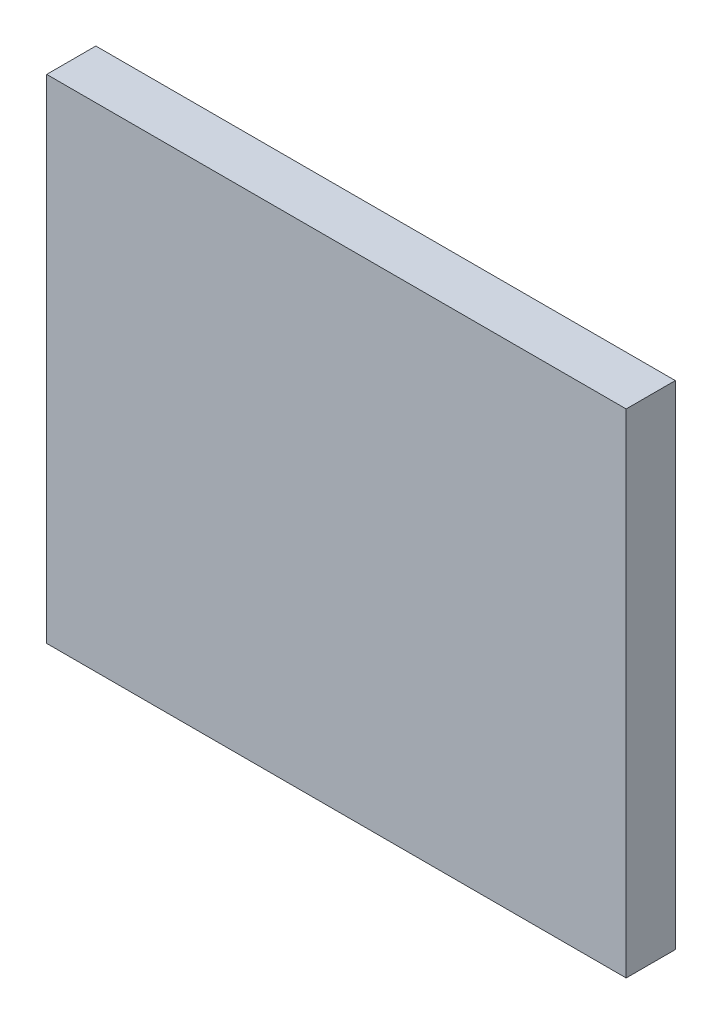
ISO-10303-21;
HEADER;
FILE_DESCRIPTION(('STEP AP214'),'2;1');
FILE_NAME('part.step','',(''),(''),'','','');
FILE_SCHEMA(('AUTOMOTIVE_DESIGN { 1 0 10303 214 1 1 1 1 }'));
ENDSEC;
DATA;
#1=APPLICATION_CONTEXT('core data for automotive mechanical design processes');
#2=APPLICATION_PROTOCOL_DEFINITION('international standard','automotive_design',2000,#1);
#3=PRODUCT_CONTEXT('',#1,'mechanical');
#4=PRODUCT('Part','Part','',(#3));
#5=PRODUCT_RELATED_PRODUCT_CATEGORY('part','',(#4));
#6=PRODUCT_DEFINITION_FORMATION('','',#4);
#7=PRODUCT_DEFINITION_CONTEXT('part definition',#1,'design');
#8=PRODUCT_DEFINITION('design','',#6,#7);
#9=PRODUCT_DEFINITION_SHAPE('','',#8);
#10=(LENGTH_UNIT() NAMED_UNIT(*) SI_UNIT(.MILLI.,.METRE.));
#11=(NAMED_UNIT(*) PLANE_ANGLE_UNIT() SI_UNIT($,.RADIAN.));
#12=(NAMED_UNIT(*) SI_UNIT($,.STERADIAN.) SOLID_ANGLE_UNIT());
#13=UNCERTAINTY_MEASURE_WITH_UNIT(LENGTH_MEASURE(1.E-05),#10,'distance_accuracy_value','');
#14=(GEOMETRIC_REPRESENTATION_CONTEXT(3) GLOBAL_UNCERTAINTY_ASSIGNED_CONTEXT((#13)) GLOBAL_UNIT_ASSIGNED_CONTEXT((#10,
#11,#12)) REPRESENTATION_CONTEXT('',''));
#15=CARTESIAN_POINT('',(0.,0.,0.));
#16=DIRECTION('',(0.,0.,1.));
#17=DIRECTION('',(1.,0.,0.));
#18=AXIS2_PLACEMENT_3D('',#15,#16,#17);
#19=CARTESIAN_POINT('',(5.59999896,4.7625,0.95));
#20=DIRECTION('',(0.,0.,1.));
#21=DIRECTION('',(1.,0.,0.));
#22=AXIS2_PLACEMENT_3D('',#19,#20,#21);
#23=PLANE('',#22);
#24=DIRECTION('',(1.,0.,0.));
#25=VECTOR('',#24,1.);
#26=CARTESIAN_POINT('',(5.59999896,-4.7625,0.95));
#27=LINE('',#26,#25);
#28=CARTESIAN_POINT('',(5.59999896,-4.7625,0.95));
#29=VERTEX_POINT('',#28);
#30=CARTESIAN_POINT('',(-5.59999896,-4.7625,0.95));
#31=VERTEX_POINT('',#30);
#32=EDGE_CURVE('E53',#29,#31,#27,.F.);
#33=ORIENTED_EDGE('',*,*,#32,.F.);
#34=DIRECTION('',(0.,1.,0.));
#35=VECTOR('',#34,1.);
#36=CARTESIAN_POINT('',(5.59999896,4.7625,0.95));
#37=LINE('',#36,#35);
#38=CARTESIAN_POINT('',(5.59999896,4.7625,0.95));
#39=VERTEX_POINT('',#38);
#40=EDGE_CURVE('E68',#39,#29,#37,.F.);
#41=ORIENTED_EDGE('',*,*,#40,.F.);
#42=DIRECTION('',(1.,0.,0.));
#43=VECTOR('',#42,1.);
#44=CARTESIAN_POINT('',(-5.59999896,4.7625,0.95));
#45=LINE('',#44,#43);
#46=CARTESIAN_POINT('',(-5.59999896,4.7625,0.95));
#47=VERTEX_POINT('',#46);
#48=EDGE_CURVE('E20',#47,#39,#45,.T.);
#49=ORIENTED_EDGE('',*,*,#48,.F.);
#50=DIRECTION('',(0.,1.,0.));
#51=VECTOR('',#50,1.);
#52=CARTESIAN_POINT('',(-5.59999896,-4.7625,0.95));
#53=LINE('',#52,#51);
#54=EDGE_CURVE('E58',#31,#47,#53,.T.);
#55=ORIENTED_EDGE('',*,*,#54,.F.);
#56=EDGE_LOOP('',(#33,#41,#49,#55));
#57=FACE_BOUND('',#56,.T.);
#58=ADVANCED_FACE('F17',(#57),#23,.T.);
#59=CARTESIAN_POINT('',(-5.59999896,4.7625,0.));
#60=DIRECTION('',(0.,1.,0.));
#61=DIRECTION('',(0.,0.,1.));
#62=AXIS2_PLACEMENT_3D('',#59,#60,#61);
#63=PLANE('',#62);
#64=DIRECTION('',(0.,0.,-1.));
#65=VECTOR('',#64,1.);
#66=CARTESIAN_POINT('',(5.59999896,4.7625,0.));
#67=LINE('',#66,#65);
#68=CARTESIAN_POINT('',(5.59999896,4.7625,0.));
#69=VERTEX_POINT('',#68);
#70=EDGE_CURVE('E79',#69,#39,#67,.F.);
#71=ORIENTED_EDGE('',*,*,#70,.F.);
#72=DIRECTION('',(1.,0.,0.));
#73=VECTOR('',#72,1.);
#74=CARTESIAN_POINT('',(5.59999896,4.7625,0.));
#75=LINE('',#74,#73);
#76=CARTESIAN_POINT('',(-5.59999896,4.7625,0.));
#77=VERTEX_POINT('',#76);
#78=EDGE_CURVE('E74',#69,#77,#75,.F.);
#79=ORIENTED_EDGE('',*,*,#78,.T.);
#80=DIRECTION('',(0.,0.,1.));
#81=VECTOR('',#80,1.);
#82=CARTESIAN_POINT('',(-5.59999896,4.7625,0.));
#83=LINE('',#82,#81);
#84=EDGE_CURVE('E63',#47,#77,#83,.F.);
#85=ORIENTED_EDGE('',*,*,#84,.F.);
#86=ORIENTED_EDGE('',*,*,#48,.T.);
#87=EDGE_LOOP('',(#71,#79,#85,#86));
#88=FACE_BOUND('',#87,.T.);
#89=ADVANCED_FACE('F73',(#88),#63,.T.);
#90=CARTESIAN_POINT('',(-5.59999896,-4.7625,0.));
#91=DIRECTION('',(-1.,0.,0.));
#92=DIRECTION('',(0.,0.,1.));
#93=AXIS2_PLACEMENT_3D('',#90,#91,#92);
#94=PLANE('',#93);
#95=ORIENTED_EDGE('',*,*,#84,.T.);
#96=DIRECTION('',(0.,1.,0.));
#97=VECTOR('',#96,1.);
#98=CARTESIAN_POINT('',(-5.59999896,4.7625,0.));
#99=LINE('',#98,#97);
#100=CARTESIAN_POINT('',(-5.59999896,-4.7625,0.));
#101=VERTEX_POINT('',#100);
#102=EDGE_CURVE('E84',#77,#101,#99,.F.);
#103=ORIENTED_EDGE('',*,*,#102,.T.);
#104=DIRECTION('',(0.,0.,-1.));
#105=VECTOR('',#104,1.);
#106=CARTESIAN_POINT('',(-5.59999896,-4.7625,0.));
#107=LINE('',#106,#105);
#108=EDGE_CURVE('E65',#31,#101,#107,.T.);
#109=ORIENTED_EDGE('',*,*,#108,.F.);
#110=ORIENTED_EDGE('',*,*,#54,.T.);
#111=EDGE_LOOP('',(#95,#103,#109,#110));
#112=FACE_BOUND('',#111,.T.);
#113=ADVANCED_FACE('F60',(#112),#94,.T.);
#114=CARTESIAN_POINT('',(5.59999896,-4.7625,0.));
#115=DIRECTION('',(0.,-1.,0.));
#116=DIRECTION('',(0.,0.,-1.));
#117=AXIS2_PLACEMENT_3D('',#114,#115,#116);
#118=PLANE('',#117);
#119=ORIENTED_EDGE('',*,*,#108,.T.);
#120=DIRECTION('',(1.,0.,0.));
#121=VECTOR('',#120,1.);
#122=CARTESIAN_POINT('',(5.59999896,-4.7625,0.));
#123=LINE('',#122,#121);
#124=CARTESIAN_POINT('',(5.59999896,-4.7625,0.));
#125=VERTEX_POINT('',#124);
#126=EDGE_CURVE('E26',#101,#125,#123,.T.);
#127=ORIENTED_EDGE('',*,*,#126,.T.);
#128=DIRECTION('',(0.,0.,-1.));
#129=VECTOR('',#128,1.);
#130=CARTESIAN_POINT('',(5.59999896,-4.7625,0.));
#131=LINE('',#130,#129);
#132=EDGE_CURVE('E34',#29,#125,#131,.T.);
#133=ORIENTED_EDGE('',*,*,#132,.F.);
#134=ORIENTED_EDGE('',*,*,#32,.T.);
#135=EDGE_LOOP('',(#119,#127,#133,#134));
#136=FACE_BOUND('',#135,.T.);
#137=ADVANCED_FACE('F88',(#136),#118,.T.);
#138=CARTESIAN_POINT('',(5.59999896,4.7625,0.));
#139=DIRECTION('',(1.,0.,0.));
#140=DIRECTION('',(0.,0.,-1.));
#141=AXIS2_PLACEMENT_3D('',#138,#139,#140);
#142=PLANE('',#141);
#143=ORIENTED_EDGE('',*,*,#132,.T.);
#144=DIRECTION('',(0.,1.,0.));
#145=VECTOR('',#144,1.);
#146=CARTESIAN_POINT('',(5.59999896,4.7625,0.));
#147=LINE('',#146,#145);
#148=EDGE_CURVE('E11',#125,#69,#147,.T.);
#149=ORIENTED_EDGE('',*,*,#148,.T.);
#150=ORIENTED_EDGE('',*,*,#70,.T.);
#151=ORIENTED_EDGE('',*,*,#40,.T.);
#152=EDGE_LOOP('',(#143,#149,#150,#151));
#153=FACE_BOUND('',#152,.T.);
#154=ADVANCED_FACE('F91',(#153),#142,.T.);
#155=CARTESIAN_POINT('',(5.59999896,4.7625,0.));
#156=DIRECTION('',(0.,0.,1.));
#157=DIRECTION('',(1.,0.,0.));
#158=AXIS2_PLACEMENT_3D('',#155,#156,#157);
#159=PLANE('',#158);
#160=ORIENTED_EDGE('',*,*,#126,.F.);
#161=ORIENTED_EDGE('',*,*,#102,.F.);
#162=ORIENTED_EDGE('',*,*,#78,.F.);
#163=ORIENTED_EDGE('',*,*,#148,.F.);
#164=EDGE_LOOP('',(#160,#161,#162,#163));
#165=FACE_BOUND('',#164,.T.);
#166=ADVANCED_FACE('F90',(#165),#159,.F.);
#167=CLOSED_SHELL('',(#58,#89,#113,#137,#154,#166));
#168=MANIFOLD_SOLID_BREP('B1',#167);
#169=ADVANCED_BREP_SHAPE_REPRESENTATION('',(#18,#168),#14);
#170=SHAPE_DEFINITION_REPRESENTATION(#9,#169);
ENDSEC;
END-ISO-10303-21;
